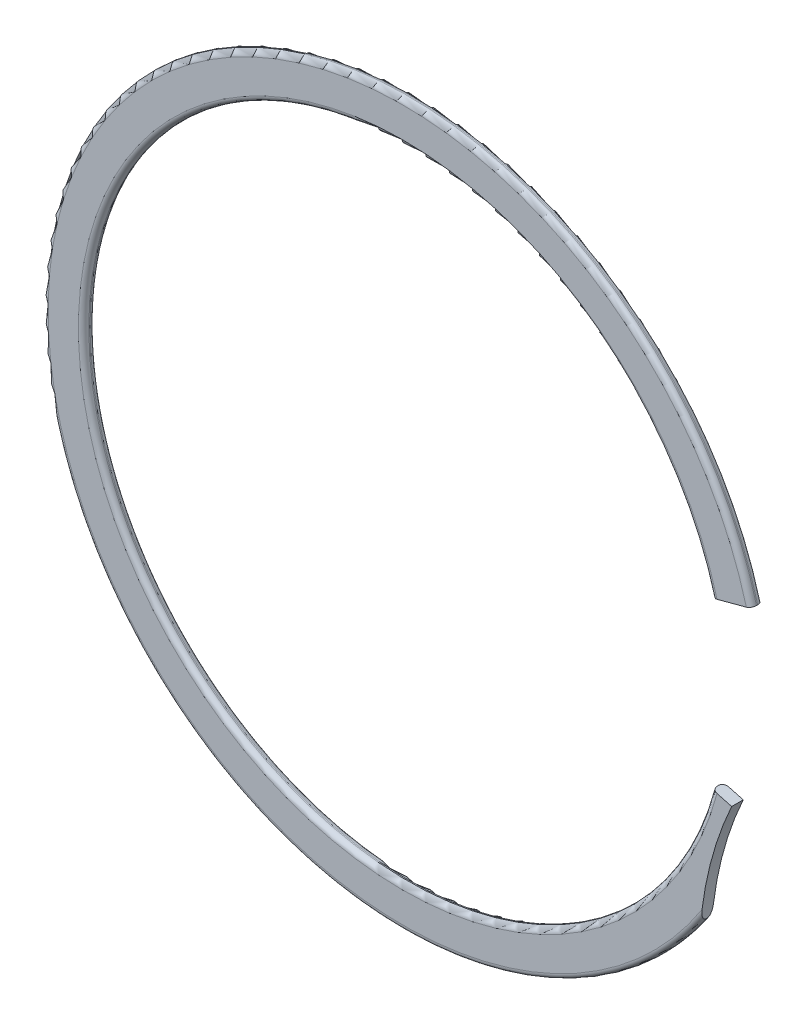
ISO-10303-21;
HEADER;
FILE_DESCRIPTION(('STEP AP214'),'2;1');
FILE_NAME('part.step','',(''),(''),'','','');
FILE_SCHEMA(('AUTOMOTIVE_DESIGN { 1 0 10303 214 1 1 1 1 }'));
ENDSEC;
DATA;
#1=APPLICATION_CONTEXT('core data for automotive mechanical design processes');
#2=APPLICATION_PROTOCOL_DEFINITION('international standard','automotive_design',2000,#1);
#3=PRODUCT_CONTEXT('',#1,'mechanical');
#4=PRODUCT('Part','Part','',(#3));
#5=PRODUCT_RELATED_PRODUCT_CATEGORY('part','',(#4));
#6=PRODUCT_DEFINITION_FORMATION('','',#4);
#7=PRODUCT_DEFINITION_CONTEXT('part definition',#1,'design');
#8=PRODUCT_DEFINITION('design','',#6,#7);
#9=PRODUCT_DEFINITION_SHAPE('','',#8);
#10=(LENGTH_UNIT() NAMED_UNIT(*) SI_UNIT(.MILLI.,.METRE.));
#11=(NAMED_UNIT(*) PLANE_ANGLE_UNIT() SI_UNIT($,.RADIAN.));
#12=(NAMED_UNIT(*) SI_UNIT($,.STERADIAN.) SOLID_ANGLE_UNIT());
#13=UNCERTAINTY_MEASURE_WITH_UNIT(LENGTH_MEASURE(1.E-05),#10,'distance_accuracy_value','');
#14=(GEOMETRIC_REPRESENTATION_CONTEXT(3) GLOBAL_UNCERTAINTY_ASSIGNED_CONTEXT((#13)) GLOBAL_UNIT_ASSIGNED_CONTEXT((#10,
#11,#12)) REPRESENTATION_CONTEXT('',''));
#15=CARTESIAN_POINT('',(0.,0.,0.));
#16=DIRECTION('',(0.,0.,1.));
#17=DIRECTION('',(1.,0.,0.));
#18=AXIS2_PLACEMENT_3D('',#15,#16,#17);
#19=CARTESIAN_POINT('',(0.,0.,0.3175));
#20=DIRECTION('',(0.,0.,-1.));
#21=DIRECTION('',(-1.,0.,0.));
#22=AXIS2_PLACEMENT_3D('',#19,#20,#21);
#23=CYLINDRICAL_SURFACE('',#22,17.5641);
#24=DIRECTION('',(0.,0.,-1.));
#25=VECTOR('',#24,1.);
#26=CARTESIAN_POINT('',(16.9656178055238,-4.5459235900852,0.3175));
#27=LINE('',#26,#25);
#28=CARTESIAN_POINT('',(16.9656178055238,-4.5459235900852,0.03175));
#29=VERTEX_POINT('',#28);
#30=CARTESIAN_POINT('',(16.9656178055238,-4.5459235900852,-0.03175));
#31=VERTEX_POINT('',#30);
#32=EDGE_CURVE('E159',#29,#31,#27,.T.);
#33=ORIENTED_EDGE('',*,*,#32,.T.);
#34=CARTESIAN_POINT('',(0.,0.,-0.03175));
#35=DIRECTION('',(0.,0.,1.));
#36=DIRECTION('',(1.,0.,0.));
#37=AXIS2_PLACEMENT_3D('',#34,#35,#36);
#38=CIRCLE('',#37,17.5641);
#39=CARTESIAN_POINT('',(16.9656178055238,4.5459235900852,-0.03175));
#40=VERTEX_POINT('',#39);
#41=EDGE_CURVE('E195',#31,#40,#38,.F.);
#42=ORIENTED_EDGE('',*,*,#41,.T.);
#43=DIRECTION('',(0.,0.,-1.));
#44=VECTOR('',#43,1.);
#45=CARTESIAN_POINT('',(16.9656178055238,4.5459235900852,0.3175));
#46=LINE('',#45,#44);
#47=CARTESIAN_POINT('',(16.9656178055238,4.5459235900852,0.03175));
#48=VERTEX_POINT('',#47);
#49=EDGE_CURVE('E188',#48,#40,#46,.T.);
#50=ORIENTED_EDGE('',*,*,#49,.F.);
#51=CARTESIAN_POINT('',(0.,0.,0.03175));
#52=DIRECTION('',(0.,0.,1.));
#53=DIRECTION('',(1.,0.,0.));
#54=AXIS2_PLACEMENT_3D('',#51,#52,#53);
#55=CIRCLE('',#54,17.5641);
#56=EDGE_CURVE('E192',#48,#29,#55,.T.);
#57=ORIENTED_EDGE('',*,*,#56,.T.);
#58=EDGE_LOOP('',(#33,#42,#50,#57));
#59=FACE_BOUND('',#58,.T.);
#60=ADVANCED_FACE('F43',(#59),#23,.F.);
#61=CARTESIAN_POINT('',(16.9656178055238,4.5459235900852,0.3175));
#62=DIRECTION('',(-0.258819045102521,0.965925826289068,0.));
#63=DIRECTION('',(-0.965925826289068,-0.258819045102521,0.));
#64=AXIS2_PLACEMENT_3D('',#61,#62,#63);
#65=PLANE('',#64);
#66=ORIENTED_EDGE('',*,*,#49,.T.);
#67=CARTESIAN_POINT('',(17.2416311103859,4.61988113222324,-0.03175));
#68=DIRECTION('',(-0.258819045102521,0.965925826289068,0.));
#69=DIRECTION('',(-0.965925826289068,-0.258819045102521,0.));
#70=AXIS2_PLACEMENT_3D('',#67,#68,#69);
#71=CIRCLE('',#70,0.28575);
#72=CARTESIAN_POINT('',(17.2416311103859,4.61988113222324,-0.3175));
#73=VERTEX_POINT('',#72);
#74=EDGE_CURVE('E208',#40,#73,#71,.F.);
#75=ORIENTED_EDGE('',*,*,#74,.T.);
#76=DIRECTION('',(0.965925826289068,0.258819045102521,0.));
#77=VECTOR('',#76,1.);
#78=CARTESIAN_POINT('',(16.9656178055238,4.5459235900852,-0.3175));
#79=LINE('',#78,#77);
#80=CARTESIAN_POINT('',(18.848641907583,5.05047837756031,-0.3175));
#81=VERTEX_POINT('',#80);
#82=EDGE_CURVE('E174',#73,#81,#79,.T.);
#83=ORIENTED_EDGE('',*,*,#82,.T.);
#84=CARTESIAN_POINT('',(18.848641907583,5.05047837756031,-0.03175));
#85=DIRECTION('',(-0.258819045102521,0.965925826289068,0.));
#86=DIRECTION('',(-0.965925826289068,-0.258819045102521,0.));
#87=AXIS2_PLACEMENT_3D('',#84,#85,#86);
#88=CIRCLE('',#87,0.28575);
#89=CARTESIAN_POINT('',(19.1246552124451,5.12443591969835,-0.03175));
#90=VERTEX_POINT('',#89);
#91=EDGE_CURVE('E202',#81,#90,#88,.F.);
#92=ORIENTED_EDGE('',*,*,#91,.T.);
#93=DIRECTION('',(0.,0.,-1.));
#94=VECTOR('',#93,1.);
#95=CARTESIAN_POINT('',(19.1246552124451,5.12443591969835,0.3175));
#96=LINE('',#95,#94);
#97=CARTESIAN_POINT('',(19.1246552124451,5.12443591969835,0.03175));
#98=VERTEX_POINT('',#97);
#99=EDGE_CURVE('E184',#98,#90,#96,.T.);
#100=ORIENTED_EDGE('',*,*,#99,.F.);
#101=CARTESIAN_POINT('',(18.848641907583,5.05047837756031,0.03175));
#102=DIRECTION('',(-0.258819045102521,0.965925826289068,0.));
#103=DIRECTION('',(-0.965925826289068,-0.258819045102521,0.));
#104=AXIS2_PLACEMENT_3D('',#101,#102,#103);
#105=CIRCLE('',#104,0.28575);
#106=CARTESIAN_POINT('',(18.848641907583,5.05047837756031,0.3175));
#107=VERTEX_POINT('',#106);
#108=EDGE_CURVE('E199',#98,#107,#105,.F.);
#109=ORIENTED_EDGE('',*,*,#108,.T.);
#110=DIRECTION('',(0.965925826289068,0.258819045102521,0.));
#111=VECTOR('',#110,1.);
#112=CARTESIAN_POINT('',(16.9656178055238,4.5459235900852,0.3175));
#113=LINE('',#112,#111);
#114=CARTESIAN_POINT('',(17.2416311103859,4.61988113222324,0.3175));
#115=VERTEX_POINT('',#114);
#116=EDGE_CURVE('E147',#115,#107,#113,.T.);
#117=ORIENTED_EDGE('',*,*,#116,.F.);
#118=CARTESIAN_POINT('',(17.2416311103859,4.61988113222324,0.03175));
#119=DIRECTION('',(-0.258819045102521,0.965925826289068,0.));
#120=DIRECTION('',(-0.965925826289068,-0.258819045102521,0.));
#121=AXIS2_PLACEMENT_3D('',#118,#119,#120);
#122=CIRCLE('',#121,0.28575);
#123=EDGE_CURVE('E205',#115,#48,#122,.F.);
#124=ORIENTED_EDGE('',*,*,#123,.T.);
#125=EDGE_LOOP('',(#66,#75,#83,#92,#100,#109,#117,#124));
#126=FACE_BOUND('',#125,.T.);
#127=ADVANCED_FACE('F244',(#126),#65,.F.);
#128=CARTESIAN_POINT('',(0.,0.,0.3175));
#129=DIRECTION('',(0.,0.,-1.));
#130=DIRECTION('',(-1.,0.,0.));
#131=AXIS2_PLACEMENT_3D('',#128,#129,#130);
#132=CYLINDRICAL_SURFACE('',#131,19.7993);
#133=ORIENTED_EDGE('',*,*,#99,.T.);
#134=CARTESIAN_POINT('',(0.,0.,-0.03175));
#135=DIRECTION('',(0.,0.,1.));
#136=DIRECTION('',(1.,0.,0.));
#137=AXIS2_PLACEMENT_3D('',#134,#135,#136);
#138=CIRCLE('',#137,19.7993);
#139=CARTESIAN_POINT('',(16.3478209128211,-11.1696477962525,-0.03175));
#140=VERTEX_POINT('',#139);
#141=EDGE_CURVE('E229',#90,#140,#138,.T.);
#142=ORIENTED_EDGE('',*,*,#141,.T.);
#143=DIRECTION('',(0.,0.,-1.));
#144=VECTOR('',#143,1.);
#145=CARTESIAN_POINT('',(16.3478209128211,-11.1696477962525,0.3175));
#146=LINE('',#145,#144);
#147=CARTESIAN_POINT('',(16.3478209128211,-11.1696477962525,0.03175));
#148=VERTEX_POINT('',#147);
#149=EDGE_CURVE('E158',#148,#140,#146,.T.);
#150=ORIENTED_EDGE('',*,*,#149,.F.);
#151=CARTESIAN_POINT('',(0.,0.,0.03175));
#152=DIRECTION('',(0.,0.,1.));
#153=DIRECTION('',(1.,0.,0.));
#154=AXIS2_PLACEMENT_3D('',#151,#152,#153);
#155=CIRCLE('',#154,19.7993);
#156=EDGE_CURVE('E226',#148,#98,#155,.F.);
#157=ORIENTED_EDGE('',*,*,#156,.T.);
#158=EDGE_LOOP('',(#133,#142,#150,#157));
#159=FACE_BOUND('',#158,.T.);
#160=ADVANCED_FACE('F239',(#159),#132,.T.);
#161=CARTESIAN_POINT('',(35.7813745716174,-12.9822216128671,0.3175));
#162=DIRECTION('',(0.,0.,-1.));
#163=DIRECTION('',(-1.,0.,0.));
#164=AXIS2_PLACEMENT_3D('',#161,#162,#163);
#165=CYLINDRICAL_SURFACE('',#164,19.5179002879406);
#166=ORIENTED_EDGE('',*,*,#149,.T.);
#167=CARTESIAN_POINT('',(16.3478209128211,-11.1696477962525,-0.03175));
#168=CARTESIAN_POINT('',(16.3478191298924,-11.1696685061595,-0.0401652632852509));
#169=CARTESIAN_POINT('',(16.3478919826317,-11.1688857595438,-0.0485541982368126));
#170=CARTESIAN_POINT('',(16.3481704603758,-11.1659030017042,-0.0649869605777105));
#171=CARTESIAN_POINT('',(16.348374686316,-11.1637179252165,-0.0730334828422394));
#172=CARTESIAN_POINT('',(16.3489599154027,-11.157474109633,-0.090457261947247));
#173=CARTESIAN_POINT('',(16.3493706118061,-11.1531017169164,-0.0997195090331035));
#174=CARTESIAN_POINT('',(16.3503319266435,-11.1429174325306,-0.117433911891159));
#175=CARTESIAN_POINT('',(16.3508831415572,-11.1370994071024,-0.125882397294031));
#176=CARTESIAN_POINT('',(16.3524191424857,-11.1209807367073,-0.146264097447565));
#177=CARTESIAN_POINT('',(16.3534772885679,-11.1099563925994,-0.157614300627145));
#178=CARTESIAN_POINT('',(16.3557647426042,-11.0863690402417,-0.178527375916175));
#179=CARTESIAN_POINT('',(16.3569943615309,-11.0738032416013,-0.188086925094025));
#180=CARTESIAN_POINT('',(16.360684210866,-11.0365072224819,-0.213279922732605));
#181=CARTESIAN_POINT('',(16.3632961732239,-11.0105789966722,-0.227099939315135));
#182=CARTESIAN_POINT('',(16.3688088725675,-10.9570147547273,-0.251066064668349));
#183=CARTESIAN_POINT('',(16.3717113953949,-10.9293686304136,-0.261187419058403));
#184=CARTESIAN_POINT('',(16.3778084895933,-10.8725078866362,-0.278726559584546));
#185=CARTESIAN_POINT('',(16.3810085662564,-10.8432713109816,-0.286070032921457));
#186=CARTESIAN_POINT('',(16.3876041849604,-10.7842711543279,-0.298262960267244));
#187=CARTESIAN_POINT('',(16.391000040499,-10.7545067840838,-0.303108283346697));
#188=CARTESIAN_POINT('',(16.3978551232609,-10.6956399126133,-0.310539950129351));
#189=CARTESIAN_POINT('',(16.4013093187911,-10.6665446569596,-0.313190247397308));
#190=CARTESIAN_POINT('',(16.4083493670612,-10.608366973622,-0.316659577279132));
#191=CARTESIAN_POINT('',(16.4119346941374,-10.5792848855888,-0.317485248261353));
#192=CARTESIAN_POINT('',(16.4155847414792,-10.5502232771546,-0.3175));
#193=B_SPLINE_CURVE_WITH_KNOTS('',3,(#167,#168,#169,#170,#171,#172,#173,#174,#175,#176,#177,
#178,#179,#180,#181,#182,#183,#184,#185,#186,#187,#188,#189,#190,#191,#192),.UNSPECIFIED.,.F.,
.F.,(4,2,2,2,2,2,2,2,2,2,2,2,4),(0.,0.0251665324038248,0.0500693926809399,0.0806514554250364,
0.111365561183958,0.15867174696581,0.206064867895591,0.294063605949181,0.38264095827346,
0.473443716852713,0.564396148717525,0.652594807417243,0.740472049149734),.UNSPECIFIED.);
#194=CARTESIAN_POINT('',(16.4155847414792,-10.5502232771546,-0.3175));
#195=VERTEX_POINT('',#194);
#196=EDGE_CURVE('E11',#140,#195,#193,.T.);
#197=ORIENTED_EDGE('',*,*,#196,.T.);
#198=CARTESIAN_POINT('',(35.7813745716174,-12.9822216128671,-0.3175));
#199=DIRECTION('',(0.,0.,-1.));
#200=DIRECTION('',(1.,0.,0.));
#201=AXIS2_PLACEMENT_3D('',#198,#199,#200);
#202=CIRCLE('',#201,19.5179002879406);
#203=CARTESIAN_POINT('',(18.0451365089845,-4.83517975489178,-0.3175));
#204=VERTEX_POINT('',#203);
#205=EDGE_CURVE('E153',#195,#204,#202,.T.);
#206=ORIENTED_EDGE('',*,*,#205,.T.);
#207=DIRECTION('',(0.,0.,-1.));
#208=VECTOR('',#207,1.);
#209=CARTESIAN_POINT('',(18.0451365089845,-4.83517975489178,0.3175));
#210=LINE('',#209,#208);
#211=CARTESIAN_POINT('',(18.0451365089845,-4.83517975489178,0.3175));
#212=VERTEX_POINT('',#211);
#213=EDGE_CURVE('E150',#212,#204,#210,.T.);
#214=ORIENTED_EDGE('',*,*,#213,.F.);
#215=CARTESIAN_POINT('',(35.7813745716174,-12.9822216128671,0.3175));
#216=DIRECTION('',(0.,0.,-1.));
#217=DIRECTION('',(1.,0.,0.));
#218=AXIS2_PLACEMENT_3D('',#215,#216,#217);
#219=CIRCLE('',#218,19.5179002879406);
#220=CARTESIAN_POINT('',(16.4155847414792,-10.5502232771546,0.3175));
#221=VERTEX_POINT('',#220);
#222=EDGE_CURVE('E136',#221,#212,#219,.T.);
#223=ORIENTED_EDGE('',*,*,#222,.F.);
#224=CARTESIAN_POINT('',(16.4155847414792,-10.5502232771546,0.3175));
#225=CARTESIAN_POINT('',(16.4118237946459,-10.5801673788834,0.317483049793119));
#226=CARTESIAN_POINT('',(16.4081313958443,-10.6101352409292,0.316607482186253));
#227=CARTESIAN_POINT('',(16.4008846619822,-10.6700899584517,0.312919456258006));
#228=CARTESIAN_POINT('',(16.397330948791,-10.7000763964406,0.310099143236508));
#229=CARTESIAN_POINT('',(16.3903689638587,-10.7600040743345,0.302271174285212));
#230=CARTESIAN_POINT('',(16.3869618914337,-10.789943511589,0.297248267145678));
#231=CARTESIAN_POINT('',(16.3803484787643,-10.849264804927,0.284639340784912));
#232=CARTESIAN_POINT('',(16.3771417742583,-10.8786476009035,0.277058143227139));
#233=CARTESIAN_POINT('',(16.3721559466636,-10.9252861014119,0.262264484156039));
#234=CARTESIAN_POINT('',(16.3703034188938,-10.9428463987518,0.256038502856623));
#235=CARTESIAN_POINT('',(16.3667013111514,-10.9774285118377,0.242173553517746));
#236=CARTESIAN_POINT('',(16.3649517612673,-10.9944501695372,0.234534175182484));
#237=CARTESIAN_POINT('',(16.3615685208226,-11.0277786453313,0.217497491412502));
#238=CARTESIAN_POINT('',(16.359935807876,-11.0440790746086,0.208087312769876));
#239=CARTESIAN_POINT('',(16.3568469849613,-11.0752861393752,0.187157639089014));
#240=CARTESIAN_POINT('',(16.3553904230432,-11.0901963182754,0.175643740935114));
#241=CARTESIAN_POINT('',(16.3533261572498,-11.1115462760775,0.155717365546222));
#242=CARTESIAN_POINT('',(16.3526287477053,-11.118807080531,0.148198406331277));
#243=CARTESIAN_POINT('',(16.3513370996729,-11.1323239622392,0.132272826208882));
#244=CARTESIAN_POINT('',(16.3507429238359,-11.1385794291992,0.123865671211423));
#245=CARTESIAN_POINT('',(16.3496833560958,-11.149780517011,0.106028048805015));
#246=CARTESIAN_POINT('',(16.3492198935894,-11.1547064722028,0.096584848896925));
#247=CARTESIAN_POINT('',(16.348476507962,-11.1626280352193,0.0769254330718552));
#248=CARTESIAN_POINT('',(16.3481957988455,-11.1656319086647,0.0667127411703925));
#249=CARTESIAN_POINT('',(16.3479564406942,-11.1681952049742,0.0522584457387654));
#250=CARTESIAN_POINT('',(16.3479058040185,-11.1687378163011,0.0481800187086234));
#251=CARTESIAN_POINT('',(16.3478380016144,-11.1694645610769,0.0399853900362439));
#252=CARTESIAN_POINT('',(16.347820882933,-11.1696481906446,0.0358691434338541));
#253=CARTESIAN_POINT('',(16.3478209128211,-11.1696477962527,0.0317500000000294));
#254=B_SPLINE_CURVE_WITH_KNOTS('',3,(#224,#225,#226,#227,#228,#229,#230,#231,#232,#233,#234,
#235,#236,#237,#238,#239,#240,#241,#242,#243,#244,#245,#246,#247,#248,#249,#250,#251,#252,#253),
.UNSPECIFIED.,.F.,.F.,(4,2,2,2,2,2,2,2,2,2,2,2,2,2,4),(0.,0.0905492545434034,0.181466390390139,
0.273023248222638,0.364408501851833,0.420531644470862,0.476671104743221,0.533235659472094,
0.589651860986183,0.621013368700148,0.652393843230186,0.684215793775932,0.715899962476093,
0.728230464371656,0.740578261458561),.UNSPECIFIED.);
#255=EDGE_CURVE('E57',#221,#148,#254,.T.);
#256=ORIENTED_EDGE('',*,*,#255,.T.);
#257=EDGE_LOOP('',(#166,#197,#206,#214,#223,#256));
#258=FACE_BOUND('',#257,.T.);
#259=ADVANCED_FACE('F151',(#258),#165,.F.);
#260=CARTESIAN_POINT('',(16.9656178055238,-4.5459235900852,0.3175));
#261=DIRECTION('',(-0.258819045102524,-0.965925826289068,0.));
#262=DIRECTION('',(0.965925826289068,-0.258819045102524,0.));
#263=AXIS2_PLACEMENT_3D('',#260,#261,#262);
#264=PLANE('',#263);
#265=DIRECTION('',(-0.965925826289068,0.258819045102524,0.));
#266=VECTOR('',#265,1.);
#267=CARTESIAN_POINT('',(16.9656178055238,-4.5459235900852,-0.3175));
#268=LINE('',#267,#266);
#269=CARTESIAN_POINT('',(17.2416311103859,-4.61988113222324,-0.3175));
#270=VERTEX_POINT('',#269);
#271=EDGE_CURVE('E179',#204,#270,#268,.T.);
#272=ORIENTED_EDGE('',*,*,#271,.T.);
#273=CARTESIAN_POINT('',(17.2416311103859,-4.61988113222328,-0.03175));
#274=DIRECTION('',(-0.258819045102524,-0.965925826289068,0.));
#275=DIRECTION('',(0.965925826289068,-0.258819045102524,0.));
#276=AXIS2_PLACEMENT_3D('',#273,#274,#275);
#277=CIRCLE('',#276,0.28575);
#278=EDGE_CURVE('E219',#270,#31,#277,.F.);
#279=ORIENTED_EDGE('',*,*,#278,.T.);
#280=ORIENTED_EDGE('',*,*,#32,.F.);
#281=CARTESIAN_POINT('',(17.2416311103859,-4.61988113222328,0.03175));
#282=DIRECTION('',(-0.258819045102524,-0.965925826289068,0.));
#283=DIRECTION('',(0.965925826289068,-0.258819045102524,0.));
#284=AXIS2_PLACEMENT_3D('',#281,#282,#283);
#285=CIRCLE('',#284,0.28575);
#286=CARTESIAN_POINT('',(17.2416311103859,-4.61988113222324,0.3175));
#287=VERTEX_POINT('',#286);
#288=EDGE_CURVE('E164',#29,#287,#285,.F.);
#289=ORIENTED_EDGE('',*,*,#288,.T.);
#290=DIRECTION('',(-0.965925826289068,0.258819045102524,0.));
#291=VECTOR('',#290,1.);
#292=CARTESIAN_POINT('',(16.9656178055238,-4.5459235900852,0.3175));
#293=LINE('',#292,#291);
#294=EDGE_CURVE('E141',#212,#287,#293,.T.);
#295=ORIENTED_EDGE('',*,*,#294,.F.);
#296=ORIENTED_EDGE('',*,*,#213,.T.);
#297=EDGE_LOOP('',(#272,#279,#280,#289,#295,#296));
#298=FACE_BOUND('',#297,.T.);
#299=ADVANCED_FACE('F161',(#298),#264,.F.);
#300=CARTESIAN_POINT('',(0.,0.,0.3175));
#301=DIRECTION('',(0.,0.,1.));
#302=DIRECTION('',(1.,0.,0.));
#303=AXIS2_PLACEMENT_3D('',#300,#301,#302);
#304=PLANE('',#303);
#305=ORIENTED_EDGE('',*,*,#294,.T.);
#306=CARTESIAN_POINT('',(0.,0.,0.3175));
#307=DIRECTION('',(0.,0.,1.));
#308=DIRECTION('',(1.,0.,0.));
#309=AXIS2_PLACEMENT_3D('',#306,#307,#308);
#310=CIRCLE('',#309,17.84985);
#311=EDGE_CURVE('E223',#287,#115,#310,.F.);
#312=ORIENTED_EDGE('',*,*,#311,.T.);
#313=ORIENTED_EDGE('',*,*,#116,.T.);
#314=CARTESIAN_POINT('',(0.,0.,0.3175));
#315=DIRECTION('',(0.,0.,1.));
#316=DIRECTION('',(1.,0.,0.));
#317=AXIS2_PLACEMENT_3D('',#314,#315,#316);
#318=CIRCLE('',#317,19.51355);
#319=EDGE_CURVE('E145',#107,#221,#318,.T.);
#320=ORIENTED_EDGE('',*,*,#319,.T.);
#321=ORIENTED_EDGE('',*,*,#222,.T.);
#322=EDGE_LOOP('',(#305,#312,#313,#320,#321));
#323=FACE_BOUND('',#322,.T.);
#324=ADVANCED_FACE('F138',(#323),#304,.T.);
#325=CARTESIAN_POINT('',(0.,0.,-0.3175));
#326=DIRECTION('',(0.,0.,1.));
#327=DIRECTION('',(1.,0.,0.));
#328=AXIS2_PLACEMENT_3D('',#325,#326,#327);
#329=PLANE('',#328);
#330=ORIENTED_EDGE('',*,*,#82,.F.);
#331=CARTESIAN_POINT('',(0.,0.,-0.3175));
#332=DIRECTION('',(0.,0.,1.));
#333=DIRECTION('',(1.,0.,0.));
#334=AXIS2_PLACEMENT_3D('',#331,#332,#333);
#335=CIRCLE('',#334,17.84985);
#336=EDGE_CURVE('E214',#73,#270,#335,.T.);
#337=ORIENTED_EDGE('',*,*,#336,.T.);
#338=ORIENTED_EDGE('',*,*,#271,.F.);
#339=ORIENTED_EDGE('',*,*,#205,.F.);
#340=CARTESIAN_POINT('',(0.,0.,-0.3175));
#341=DIRECTION('',(0.,0.,1.));
#342=DIRECTION('',(1.,0.,0.));
#343=AXIS2_PLACEMENT_3D('',#340,#341,#342);
#344=CIRCLE('',#343,19.51355);
#345=EDGE_CURVE('E211',#195,#81,#344,.F.);
#346=ORIENTED_EDGE('',*,*,#345,.T.);
#347=EDGE_LOOP('',(#330,#337,#338,#339,#346));
#348=FACE_BOUND('',#347,.T.);
#349=ADVANCED_FACE('F256',(#348),#329,.F.);
#350=CARTESIAN_POINT('',(0.,0.,-0.03175));
#351=DIRECTION('',(0.,0.,1.));
#352=DIRECTION('',(1.,0.,0.));
#353=AXIS2_PLACEMENT_3D('',#350,#351,#352);
#354=TOROIDAL_SURFACE('',#353,17.84985,0.28575);
#355=ORIENTED_EDGE('',*,*,#278,.F.);
#356=ORIENTED_EDGE('',*,*,#336,.F.);
#357=ORIENTED_EDGE('',*,*,#74,.F.);
#358=ORIENTED_EDGE('',*,*,#41,.F.);
#359=EDGE_LOOP('',(#355,#356,#357,#358));
#360=FACE_BOUND('',#359,.T.);
#361=ADVANCED_FACE('F252',(#360),#354,.T.);
#362=CARTESIAN_POINT('',(0.,0.,0.03175));
#363=DIRECTION('',(0.,0.,1.));
#364=DIRECTION('',(1.,0.,0.));
#365=AXIS2_PLACEMENT_3D('',#362,#363,#364);
#366=TOROIDAL_SURFACE('',#365,17.84985,0.28575);
#367=ORIENTED_EDGE('',*,*,#288,.F.);
#368=ORIENTED_EDGE('',*,*,#56,.F.);
#369=ORIENTED_EDGE('',*,*,#123,.F.);
#370=ORIENTED_EDGE('',*,*,#311,.F.);
#371=EDGE_LOOP('',(#367,#368,#369,#370));
#372=FACE_BOUND('',#371,.T.);
#373=ADVANCED_FACE('F255',(#372),#366,.T.);
#374=CARTESIAN_POINT('',(0.,0.,-0.03175));
#375=DIRECTION('',(0.,0.,1.));
#376=DIRECTION('',(1.,0.,0.));
#377=AXIS2_PLACEMENT_3D('',#374,#375,#376);
#378=TOROIDAL_SURFACE('',#377,19.51355,0.28575);
#379=ORIENTED_EDGE('',*,*,#91,.F.);
#380=ORIENTED_EDGE('',*,*,#345,.F.);
#381=ORIENTED_EDGE('',*,*,#196,.F.);
#382=ORIENTED_EDGE('',*,*,#141,.F.);
#383=EDGE_LOOP('',(#379,#380,#381,#382));
#384=FACE_BOUND('',#383,.T.);
#385=ADVANCED_FACE('F259',(#384),#378,.T.);
#386=CARTESIAN_POINT('',(0.,0.,0.03175));
#387=DIRECTION('',(0.,0.,1.));
#388=DIRECTION('',(1.,0.,0.));
#389=AXIS2_PLACEMENT_3D('',#386,#387,#388);
#390=TOROIDAL_SURFACE('',#389,19.51355,0.28575);
#391=ORIENTED_EDGE('',*,*,#108,.F.);
#392=ORIENTED_EDGE('',*,*,#156,.F.);
#393=ORIENTED_EDGE('',*,*,#255,.F.);
#394=ORIENTED_EDGE('',*,*,#319,.F.);
#395=EDGE_LOOP('',(#391,#392,#393,#394));
#396=FACE_BOUND('',#395,.T.);
#397=ADVANCED_FACE('F45',(#396),#390,.T.);
#398=CLOSED_SHELL('',(#60,#127,#160,#259,#299,#324,#349,#361,#373,#385,#397));
#399=MANIFOLD_SOLID_BREP('B2',#398);
#400=ADVANCED_BREP_SHAPE_REPRESENTATION('',(#18,#399),#14);
#401=SHAPE_DEFINITION_REPRESENTATION(#9,#400);
ENDSEC;
END-ISO-10303-21;
